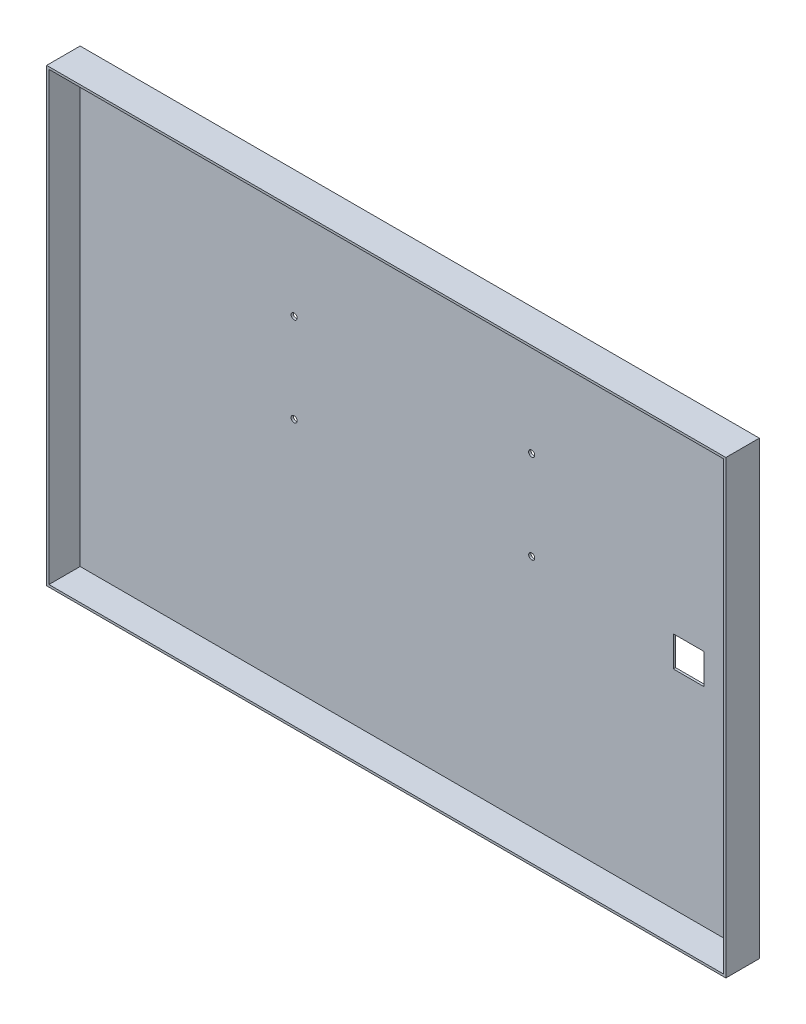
ISO-10303-21;
HEADER;
FILE_DESCRIPTION(('STEP AP214'),'2;1');
FILE_NAME('part.step','',(''),(''),'','','');
FILE_SCHEMA(('AUTOMOTIVE_DESIGN { 1 0 10303 214 1 1 1 1 }'));
ENDSEC;
DATA;
#1=APPLICATION_CONTEXT('core data for automotive mechanical design processes');
#2=APPLICATION_PROTOCOL_DEFINITION('international standard','automotive_design',2000,#1);
#3=PRODUCT_CONTEXT('',#1,'mechanical');
#4=PRODUCT('Part','Part','',(#3));
#5=PRODUCT_RELATED_PRODUCT_CATEGORY('part','',(#4));
#6=PRODUCT_DEFINITION_FORMATION('','',#4);
#7=PRODUCT_DEFINITION_CONTEXT('part definition',#1,'design');
#8=PRODUCT_DEFINITION('design','',#6,#7);
#9=PRODUCT_DEFINITION_SHAPE('','',#8);
#10=(LENGTH_UNIT() NAMED_UNIT(*) SI_UNIT(.MILLI.,.METRE.));
#11=(NAMED_UNIT(*) PLANE_ANGLE_UNIT() SI_UNIT($,.RADIAN.));
#12=(NAMED_UNIT(*) SI_UNIT($,.STERADIAN.) SOLID_ANGLE_UNIT());
#13=UNCERTAINTY_MEASURE_WITH_UNIT(LENGTH_MEASURE(1.E-05),#10,'distance_accuracy_value','');
#14=(GEOMETRIC_REPRESENTATION_CONTEXT(3) GLOBAL_UNCERTAINTY_ASSIGNED_CONTEXT((#13)) GLOBAL_UNIT_ASSIGNED_CONTEXT((#10,
#11,#12)) REPRESENTATION_CONTEXT('',''));
#15=CARTESIAN_POINT('',(0.,0.,0.));
#16=DIRECTION('',(0.,0.,1.));
#17=DIRECTION('',(1.,0.,0.));
#18=AXIS2_PLACEMENT_3D('',#15,#16,#17);
#19=CARTESIAN_POINT('',(-221.5,146.5,1.49999999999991));
#20=DIRECTION('',(-1.,0.,0.));
#21=DIRECTION('',(0.,-1.,0.));
#22=AXIS2_PLACEMENT_3D('',#19,#20,#21);
#23=PLANE('',#22);
#24=DIRECTION('',(0.,0.,-1.));
#25=VECTOR('',#24,1.);
#26=CARTESIAN_POINT('',(-221.5,-146.5,1.50000000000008));
#27=LINE('',#26,#25);
#28=CARTESIAN_POINT('',(-221.5,-146.5,22.0000000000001));
#29=VERTEX_POINT('',#28);
#30=CARTESIAN_POINT('',(-221.5,-146.5,1.5));
#31=VERTEX_POINT('',#30);
#32=EDGE_CURVE('E123',#29,#31,#27,.T.);
#33=ORIENTED_EDGE('',*,*,#32,.T.);
#34=DIRECTION('',(0.,-1.,0.));
#35=VECTOR('',#34,1.);
#36=CARTESIAN_POINT('',(-221.5,-146.5,1.50000000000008));
#37=LINE('',#36,#35);
#38=CARTESIAN_POINT('',(-221.5,146.5,1.49999999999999));
#39=VERTEX_POINT('',#38);
#40=EDGE_CURVE('E110',#39,#31,#37,.T.);
#41=ORIENTED_EDGE('',*,*,#40,.F.);
#42=DIRECTION('',(0.,0.,1.));
#43=VECTOR('',#42,1.);
#44=CARTESIAN_POINT('',(-221.5,146.5,1.49999999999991));
#45=LINE('',#44,#43);
#46=CARTESIAN_POINT('',(-221.5,146.5,22.0000000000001));
#47=VERTEX_POINT('',#46);
#48=EDGE_CURVE('E104',#39,#47,#45,.T.);
#49=ORIENTED_EDGE('',*,*,#48,.T.);
#50=DIRECTION('',(0.,-1.,0.));
#51=VECTOR('',#50,1.);
#52=CARTESIAN_POINT('',(-221.5,-148.,22.0000000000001));
#53=LINE('',#52,#51);
#54=EDGE_CURVE('E124',#29,#47,#53,.F.);
#55=ORIENTED_EDGE('',*,*,#54,.F.);
#56=EDGE_LOOP('',(#33,#41,#49,#55));
#57=FACE_BOUND('',#56,.T.);
#58=ADVANCED_FACE('F17',(#57),#23,.F.);
#59=CARTESIAN_POINT('',(-221.5,146.5,1.49999999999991));
#60=DIRECTION('',(0.,1.,0.));
#61=DIRECTION('',(0.,0.,1.));
#62=AXIS2_PLACEMENT_3D('',#59,#60,#61);
#63=PLANE('',#62);
#64=ORIENTED_EDGE('',*,*,#48,.F.);
#65=DIRECTION('',(1.,0.,0.));
#66=VECTOR('',#65,1.);
#67=CARTESIAN_POINT('',(-221.5,146.5,1.50000000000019));
#68=LINE('',#67,#66);
#69=CARTESIAN_POINT('',(221.5,146.5,1.50000000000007));
#70=VERTEX_POINT('',#69);
#71=EDGE_CURVE('E118',#70,#39,#68,.F.);
#72=ORIENTED_EDGE('',*,*,#71,.F.);
#73=DIRECTION('',(0.,0.,1.));
#74=VECTOR('',#73,1.);
#75=CARTESIAN_POINT('',(221.5,146.5,1.49999999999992));
#76=LINE('',#75,#74);
#77=CARTESIAN_POINT('',(221.5,146.5,22.));
#78=VERTEX_POINT('',#77);
#79=EDGE_CURVE('E128',#70,#78,#76,.T.);
#80=ORIENTED_EDGE('',*,*,#79,.T.);
#81=DIRECTION('',(1.,0.,0.));
#82=VECTOR('',#81,1.);
#83=CARTESIAN_POINT('',(-223.,146.5,22.0000000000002));
#84=LINE('',#83,#82);
#85=EDGE_CURVE('E198',#47,#78,#84,.T.);
#86=ORIENTED_EDGE('',*,*,#85,.F.);
#87=EDGE_LOOP('',(#64,#72,#80,#86));
#88=FACE_BOUND('',#87,.T.);
#89=ADVANCED_FACE('F202',(#88),#63,.F.);
#90=CARTESIAN_POINT('',(221.5,146.5,1.49999999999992));
#91=DIRECTION('',(1.,0.,0.));
#92=DIRECTION('',(0.,1.,0.));
#93=AXIS2_PLACEMENT_3D('',#90,#91,#92);
#94=PLANE('',#93);
#95=ORIENTED_EDGE('',*,*,#79,.F.);
#96=DIRECTION('',(0.,-1.,0.));
#97=VECTOR('',#96,1.);
#98=CARTESIAN_POINT('',(221.5,-146.5,1.50000000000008));
#99=LINE('',#98,#97);
#100=CARTESIAN_POINT('',(221.5,-146.5,1.50000000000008));
#101=VERTEX_POINT('',#100);
#102=EDGE_CURVE('E132',#101,#70,#99,.F.);
#103=ORIENTED_EDGE('',*,*,#102,.F.);
#104=DIRECTION('',(0.,0.,-1.));
#105=VECTOR('',#104,1.);
#106=CARTESIAN_POINT('',(221.5,-146.5,1.50000000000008));
#107=LINE('',#106,#105);
#108=CARTESIAN_POINT('',(221.5,-146.5,22.));
#109=VERTEX_POINT('',#108);
#110=EDGE_CURVE('E120',#101,#109,#107,.F.);
#111=ORIENTED_EDGE('',*,*,#110,.T.);
#112=DIRECTION('',(0.,-1.,0.));
#113=VECTOR('',#112,1.);
#114=CARTESIAN_POINT('',(221.5,-148.,22.0000000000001));
#115=LINE('',#114,#113);
#116=EDGE_CURVE('E196',#78,#109,#115,.T.);
#117=ORIENTED_EDGE('',*,*,#116,.F.);
#118=EDGE_LOOP('',(#95,#103,#111,#117));
#119=FACE_BOUND('',#118,.T.);
#120=ADVANCED_FACE('F205',(#119),#94,.F.);
#121=CARTESIAN_POINT('',(-221.5,-146.5,1.50000000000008));
#122=DIRECTION('',(0.,-1.,0.));
#123=DIRECTION('',(0.,0.,-1.));
#124=AXIS2_PLACEMENT_3D('',#121,#122,#123);
#125=PLANE('',#124);
#126=ORIENTED_EDGE('',*,*,#110,.F.);
#127=DIRECTION('',(1.,0.,0.));
#128=VECTOR('',#127,1.);
#129=CARTESIAN_POINT('',(-221.5,-146.5,1.50000000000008));
#130=LINE('',#129,#128);
#131=EDGE_CURVE('E116',#31,#101,#130,.T.);
#132=ORIENTED_EDGE('',*,*,#131,.F.);
#133=ORIENTED_EDGE('',*,*,#32,.F.);
#134=DIRECTION('',(1.,0.,0.));
#135=VECTOR('',#134,1.);
#136=CARTESIAN_POINT('',(-223.,-146.5,22.0000000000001));
#137=LINE('',#136,#135);
#138=EDGE_CURVE('E194',#109,#29,#137,.F.);
#139=ORIENTED_EDGE('',*,*,#138,.F.);
#140=EDGE_LOOP('',(#126,#132,#133,#139));
#141=FACE_BOUND('',#140,.T.);
#142=ADVANCED_FACE('F130',(#141),#125,.F.);
#143=CARTESIAN_POINT('',(-221.5,-146.5,1.50000000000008));
#144=DIRECTION('',(0.,0.,1.));
#145=DIRECTION('',(0.,-1.,0.));
#146=AXIS2_PLACEMENT_3D('',#143,#144,#145);
#147=PLANE('',#146);
#148=ORIENTED_EDGE('',*,*,#102,.T.);
#149=ORIENTED_EDGE('',*,*,#71,.T.);
#150=ORIENTED_EDGE('',*,*,#40,.T.);
#151=ORIENTED_EDGE('',*,*,#131,.T.);
#152=EDGE_LOOP('',(#148,#149,#150,#151));
#153=FACE_BOUND('',#152,.T.);
#154=CARTESIAN_POINT('',(-81.,66.,1.49999999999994));
#155=DIRECTION('',(0.,0.,-1.));
#156=DIRECTION('',(0.,1.,0.));
#157=AXIS2_PLACEMENT_3D('',#154,#155,#156);
#158=CIRCLE('',#157,2.);
#159=CARTESIAN_POINT('',(-81.,68.,1.49999999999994));
#160=VERTEX_POINT('',#159);
#161=EDGE_CURVE('E155',#160,#160,#158,.T.);
#162=ORIENTED_EDGE('',*,*,#161,.T.);
#163=EDGE_LOOP('',(#162));
#164=FACE_BOUND('',#163,.T.);
#165=CARTESIAN_POINT('',(-81.,7.49999999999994,1.5));
#166=DIRECTION('',(0.,0.,-1.));
#167=DIRECTION('',(0.,1.,0.));
#168=AXIS2_PLACEMENT_3D('',#165,#166,#167);
#169=CIRCLE('',#168,2.);
#170=CARTESIAN_POINT('',(-81.,9.49999999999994,1.5));
#171=VERTEX_POINT('',#170);
#172=EDGE_CURVE('E159',#171,#171,#169,.T.);
#173=ORIENTED_EDGE('',*,*,#172,.T.);
#174=EDGE_LOOP('',(#173));
#175=FACE_BOUND('',#174,.T.);
#176=CARTESIAN_POINT('',(74.9999999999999,7.49999999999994,1.5));
#177=DIRECTION('',(0.,0.,-1.));
#178=DIRECTION('',(0.,1.,0.));
#179=AXIS2_PLACEMENT_3D('',#176,#177,#178);
#180=CIRCLE('',#179,2.);
#181=CARTESIAN_POINT('',(74.9999999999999,9.49999999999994,1.5));
#182=VERTEX_POINT('',#181);
#183=EDGE_CURVE('E161',#182,#182,#180,.T.);
#184=ORIENTED_EDGE('',*,*,#183,.T.);
#185=EDGE_LOOP('',(#184));
#186=FACE_BOUND('',#185,.T.);
#187=CARTESIAN_POINT('',(74.9999999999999,66.,1.49999999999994));
#188=DIRECTION('',(0.,0.,-1.));
#189=DIRECTION('',(0.,1.,0.));
#190=AXIS2_PLACEMENT_3D('',#187,#188,#189);
#191=CIRCLE('',#190,2.);
#192=CARTESIAN_POINT('',(74.9999999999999,68.,1.49999999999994));
#193=VERTEX_POINT('',#192);
#194=EDGE_CURVE('E20',#193,#193,#191,.T.);
#195=ORIENTED_EDGE('',*,*,#194,.T.);
#196=EDGE_LOOP('',(#195));
#197=FACE_BOUND('',#196,.T.);
#198=DIRECTION('',(0.,-1.,0.));
#199=VECTOR('',#198,1.);
#200=CARTESIAN_POINT('',(168.,9.99999999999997,1.50000000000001));
#201=LINE('',#200,#199);
#202=CARTESIAN_POINT('',(168.,-10.,1.50000000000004));
#203=VERTEX_POINT('',#202);
#204=CARTESIAN_POINT('',(168.,9.99999999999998,1.50000000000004));
#205=VERTEX_POINT('',#204);
#206=EDGE_CURVE('E192',#203,#205,#201,.F.);
#207=ORIENTED_EDGE('',*,*,#206,.T.);
#208=DIRECTION('',(1.,0.,0.));
#209=VECTOR('',#208,1.);
#210=CARTESIAN_POINT('',(188.,9.99999999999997,1.5));
#211=LINE('',#210,#209);
#212=CARTESIAN_POINT('',(188.,9.99999999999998,1.50000000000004));
#213=VERTEX_POINT('',#212);
#214=EDGE_CURVE('E187',#205,#213,#211,.T.);
#215=ORIENTED_EDGE('',*,*,#214,.T.);
#216=DIRECTION('',(0.,1.,0.));
#217=VECTOR('',#216,1.);
#218=CARTESIAN_POINT('',(188.,9.99999999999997,1.5));
#219=LINE('',#218,#217);
#220=CARTESIAN_POINT('',(188.,-10.,1.50000000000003));
#221=VERTEX_POINT('',#220);
#222=EDGE_CURVE('E182',#213,#221,#219,.F.);
#223=ORIENTED_EDGE('',*,*,#222,.T.);
#224=DIRECTION('',(1.,0.,0.));
#225=VECTOR('',#224,1.);
#226=CARTESIAN_POINT('',(188.,-10.0000000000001,1.5));
#227=LINE('',#226,#225);
#228=EDGE_CURVE('E166',#221,#203,#227,.F.);
#229=ORIENTED_EDGE('',*,*,#228,.T.);
#230=EDGE_LOOP('',(#207,#215,#223,#229));
#231=FACE_BOUND('',#230,.T.);
#232=ADVANCED_FACE('F113',(#153,#164,#175,#186,#197,#231),#147,.T.);
#233=CARTESIAN_POINT('',(-223.,-148.,22.0000000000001));
#234=DIRECTION('',(0.,0.,1.));
#235=DIRECTION('',(0.,-1.,0.));
#236=AXIS2_PLACEMENT_3D('',#233,#234,#235);
#237=PLANE('',#236);
#238=DIRECTION('',(0.,-1.,0.));
#239=VECTOR('',#238,1.);
#240=CARTESIAN_POINT('',(223.,148.,22.0000000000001));
#241=LINE('',#240,#239);
#242=CARTESIAN_POINT('',(223.,-148.,22.0000000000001));
#243=VERTEX_POINT('',#242);
#244=CARTESIAN_POINT('',(223.,148.,22.0000000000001));
#245=VERTEX_POINT('',#244);
#246=EDGE_CURVE('E393',#243,#245,#241,.F.);
#247=ORIENTED_EDGE('',*,*,#246,.T.);
#248=DIRECTION('',(1.,0.,0.));
#249=VECTOR('',#248,1.);
#250=CARTESIAN_POINT('',(-223.,148.,21.9999999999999));
#251=LINE('',#250,#249);
#252=CARTESIAN_POINT('',(-223.,148.,22.));
#253=VERTEX_POINT('',#252);
#254=EDGE_CURVE('E396',#245,#253,#251,.F.);
#255=ORIENTED_EDGE('',*,*,#254,.T.);
#256=DIRECTION('',(0.,1.,0.));
#257=VECTOR('',#256,1.);
#258=CARTESIAN_POINT('',(-223.,148.,21.9999999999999));
#259=LINE('',#258,#257);
#260=CARTESIAN_POINT('',(-223.,-148.,22.0000000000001));
#261=VERTEX_POINT('',#260);
#262=EDGE_CURVE('E429',#253,#261,#259,.F.);
#263=ORIENTED_EDGE('',*,*,#262,.T.);
#264=DIRECTION('',(1.,0.,0.));
#265=VECTOR('',#264,1.);
#266=CARTESIAN_POINT('',(-223.,-148.,22.0000000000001));
#267=LINE('',#266,#265);
#268=EDGE_CURVE('E158',#261,#243,#267,.T.);
#269=ORIENTED_EDGE('',*,*,#268,.T.);
#270=EDGE_LOOP('',(#247,#255,#263,#269));
#271=FACE_BOUND('',#270,.T.);
#272=ORIENTED_EDGE('',*,*,#116,.T.);
#273=ORIENTED_EDGE('',*,*,#138,.T.);
#274=ORIENTED_EDGE('',*,*,#54,.T.);
#275=ORIENTED_EDGE('',*,*,#85,.T.);
#276=EDGE_LOOP('',(#272,#273,#274,#275));
#277=FACE_BOUND('',#276,.T.);
#278=ADVANCED_FACE('F201',(#271,#277),#237,.T.);
#279=CARTESIAN_POINT('',(168.,9.99999999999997,5.));
#280=DIRECTION('',(-1.,0.,0.));
#281=DIRECTION('',(0.,-1.,0.));
#282=AXIS2_PLACEMENT_3D('',#279,#280,#281);
#283=PLANE('',#282);
#284=DIRECTION('',(0.,0.,-1.));
#285=VECTOR('',#284,1.);
#286=CARTESIAN_POINT('',(168.,-10.0000000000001,4.99999999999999));
#287=LINE('',#286,#285);
#288=CARTESIAN_POINT('',(168.,-10.,0.));
#289=VERTEX_POINT('',#288);
#290=EDGE_CURVE('E175',#203,#289,#287,.T.);
#291=ORIENTED_EDGE('',*,*,#290,.T.);
#292=DIRECTION('',(0.,-1.,0.));
#293=VECTOR('',#292,1.);
#294=CARTESIAN_POINT('',(168.,-148.,0.));
#295=LINE('',#294,#293);
#296=CARTESIAN_POINT('',(168.,9.99999999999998,0.));
#297=VERTEX_POINT('',#296);
#298=EDGE_CURVE('E424',#289,#297,#295,.F.);
#299=ORIENTED_EDGE('',*,*,#298,.T.);
#300=DIRECTION('',(0.,0.,1.));
#301=VECTOR('',#300,1.);
#302=CARTESIAN_POINT('',(168.,9.99999999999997,5.));
#303=LINE('',#302,#301);
#304=EDGE_CURVE('E189',#297,#205,#303,.T.);
#305=ORIENTED_EDGE('',*,*,#304,.T.);
#306=ORIENTED_EDGE('',*,*,#206,.F.);
#307=EDGE_LOOP('',(#291,#299,#305,#306));
#308=FACE_BOUND('',#307,.T.);
#309=ADVANCED_FACE('F265',(#308),#283,.F.);
#310=CARTESIAN_POINT('',(188.,9.99999999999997,5.));
#311=DIRECTION('',(0.,1.,0.));
#312=DIRECTION('',(0.,0.,1.));
#313=AXIS2_PLACEMENT_3D('',#310,#311,#312);
#314=PLANE('',#313);
#315=ORIENTED_EDGE('',*,*,#304,.F.);
#316=DIRECTION('',(1.,0.,0.));
#317=VECTOR('',#316,1.);
#318=CARTESIAN_POINT('',(-223.,9.99999999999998,1.37723118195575E-13));
#319=LINE('',#318,#317);
#320=CARTESIAN_POINT('',(188.,9.99999999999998,0.));
#321=VERTEX_POINT('',#320);
#322=EDGE_CURVE('E421',#297,#321,#319,.T.);
#323=ORIENTED_EDGE('',*,*,#322,.T.);
#324=DIRECTION('',(0.,0.,1.));
#325=VECTOR('',#324,1.);
#326=CARTESIAN_POINT('',(188.,9.99999999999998,5.));
#327=LINE('',#326,#325);
#328=EDGE_CURVE('E184',#321,#213,#327,.T.);
#329=ORIENTED_EDGE('',*,*,#328,.T.);
#330=ORIENTED_EDGE('',*,*,#214,.F.);
#331=EDGE_LOOP('',(#315,#323,#329,#330));
#332=FACE_BOUND('',#331,.T.);
#333=ADVANCED_FACE('F261',(#332),#314,.F.);
#334=CARTESIAN_POINT('',(188.,9.99999999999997,5.));
#335=DIRECTION('',(1.,0.,0.));
#336=DIRECTION('',(0.,1.,0.));
#337=AXIS2_PLACEMENT_3D('',#334,#335,#336);
#338=PLANE('',#337);
#339=ORIENTED_EDGE('',*,*,#328,.F.);
#340=DIRECTION('',(0.,-1.,0.));
#341=VECTOR('',#340,1.);
#342=CARTESIAN_POINT('',(188.,-148.,0.));
#343=LINE('',#342,#341);
#344=CARTESIAN_POINT('',(188.,-10.,0.));
#345=VERTEX_POINT('',#344);
#346=EDGE_CURVE('E418',#321,#345,#343,.T.);
#347=ORIENTED_EDGE('',*,*,#346,.T.);
#348=DIRECTION('',(0.,0.,-1.));
#349=VECTOR('',#348,1.);
#350=CARTESIAN_POINT('',(188.,-10.0000000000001,4.99999999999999));
#351=LINE('',#350,#349);
#352=EDGE_CURVE('E170',#345,#221,#351,.F.);
#353=ORIENTED_EDGE('',*,*,#352,.T.);
#354=ORIENTED_EDGE('',*,*,#222,.F.);
#355=EDGE_LOOP('',(#339,#347,#353,#354));
#356=FACE_BOUND('',#355,.T.);
#357=ADVANCED_FACE('F257',(#356),#338,.F.);
#358=CARTESIAN_POINT('',(188.,-10.0000000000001,4.99999999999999));
#359=DIRECTION('',(0.,-1.,0.));
#360=DIRECTION('',(0.,0.,-1.));
#361=AXIS2_PLACEMENT_3D('',#358,#359,#360);
#362=PLANE('',#361);
#363=ORIENTED_EDGE('',*,*,#352,.F.);
#364=DIRECTION('',(1.,0.,0.));
#365=VECTOR('',#364,1.);
#366=CARTESIAN_POINT('',(-223.,-10.,1.2995156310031E-13));
#367=LINE('',#366,#365);
#368=EDGE_CURVE('E154',#345,#289,#367,.F.);
#369=ORIENTED_EDGE('',*,*,#368,.T.);
#370=ORIENTED_EDGE('',*,*,#290,.F.);
#371=ORIENTED_EDGE('',*,*,#228,.F.);
#372=EDGE_LOOP('',(#363,#369,#370,#371));
#373=FACE_BOUND('',#372,.T.);
#374=ADVANCED_FACE('F253',(#373),#362,.F.);
#375=CARTESIAN_POINT('',(74.9999999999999,66.,9.99999999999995));
#376=DIRECTION('',(0.,0.,-1.));
#377=DIRECTION('',(0.,1.,0.));
#378=AXIS2_PLACEMENT_3D('',#375,#376,#377);
#379=CYLINDRICAL_SURFACE('',#378,2.);
#380=ORIENTED_EDGE('',*,*,#194,.F.);
#381=EDGE_LOOP('',(#380));
#382=FACE_BOUND('',#381,.T.);
#383=CARTESIAN_POINT('',(74.9999999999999,66.,0.));
#384=DIRECTION('',(0.,0.,-1.));
#385=DIRECTION('',(0.,1.,0.));
#386=AXIS2_PLACEMENT_3D('',#383,#384,#385);
#387=CIRCLE('',#386,2.);
#388=CARTESIAN_POINT('',(74.9999999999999,68.,0.));
#389=VERTEX_POINT('',#388);
#390=EDGE_CURVE('E151',#389,#389,#387,.T.);
#391=ORIENTED_EDGE('',*,*,#390,.T.);
#392=EDGE_LOOP('',(#391));
#393=FACE_BOUND('',#392,.T.);
#394=ADVANCED_FACE('F249',(#382,#393),#379,.F.);
#395=CARTESIAN_POINT('',(74.9999999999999,7.49999999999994,10.));
#396=DIRECTION('',(0.,0.,-1.));
#397=DIRECTION('',(0.,1.,0.));
#398=AXIS2_PLACEMENT_3D('',#395,#396,#397);
#399=CYLINDRICAL_SURFACE('',#398,2.);
#400=ORIENTED_EDGE('',*,*,#183,.F.);
#401=EDGE_LOOP('',(#400));
#402=FACE_BOUND('',#401,.T.);
#403=CARTESIAN_POINT('',(74.9999999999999,7.49999999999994,0.));
#404=DIRECTION('',(0.,0.,-1.));
#405=DIRECTION('',(0.,1.,0.));
#406=AXIS2_PLACEMENT_3D('',#403,#404,#405);
#407=CIRCLE('',#406,2.);
#408=CARTESIAN_POINT('',(74.9999999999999,9.49999999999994,0.));
#409=VERTEX_POINT('',#408);
#410=EDGE_CURVE('E148',#409,#409,#407,.T.);
#411=ORIENTED_EDGE('',*,*,#410,.T.);
#412=EDGE_LOOP('',(#411));
#413=FACE_BOUND('',#412,.T.);
#414=ADVANCED_FACE('F245',(#402,#413),#399,.F.);
#415=CARTESIAN_POINT('',(-81.,7.49999999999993,10.));
#416=DIRECTION('',(0.,0.,-1.));
#417=DIRECTION('',(0.,1.,0.));
#418=AXIS2_PLACEMENT_3D('',#415,#416,#417);
#419=CYLINDRICAL_SURFACE('',#418,2.);
#420=ORIENTED_EDGE('',*,*,#172,.F.);
#421=EDGE_LOOP('',(#420));
#422=FACE_BOUND('',#421,.T.);
#423=CARTESIAN_POINT('',(-81.,7.49999999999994,0.));
#424=DIRECTION('',(0.,0.,-1.));
#425=DIRECTION('',(0.,1.,0.));
#426=AXIS2_PLACEMENT_3D('',#423,#424,#425);
#427=CIRCLE('',#426,2.);
#428=CARTESIAN_POINT('',(-81.,9.49999999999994,0.));
#429=VERTEX_POINT('',#428);
#430=EDGE_CURVE('E145',#429,#429,#427,.T.);
#431=ORIENTED_EDGE('',*,*,#430,.T.);
#432=EDGE_LOOP('',(#431));
#433=FACE_BOUND('',#432,.T.);
#434=ADVANCED_FACE('F241',(#422,#433),#419,.F.);
#435=CARTESIAN_POINT('',(-81.,66.,9.99999999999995));
#436=DIRECTION('',(0.,0.,-1.));
#437=DIRECTION('',(0.,1.,0.));
#438=AXIS2_PLACEMENT_3D('',#435,#436,#437);
#439=CYLINDRICAL_SURFACE('',#438,2.);
#440=ORIENTED_EDGE('',*,*,#161,.F.);
#441=EDGE_LOOP('',(#440));
#442=FACE_BOUND('',#441,.T.);
#443=CARTESIAN_POINT('',(-81.,66.,0.));
#444=DIRECTION('',(0.,0.,-1.));
#445=DIRECTION('',(0.,1.,0.));
#446=AXIS2_PLACEMENT_3D('',#443,#444,#445);
#447=CIRCLE('',#446,2.);
#448=CARTESIAN_POINT('',(-81.,68.,0.));
#449=VERTEX_POINT('',#448);
#450=EDGE_CURVE('E141',#449,#449,#447,.T.);
#451=ORIENTED_EDGE('',*,*,#450,.T.);
#452=EDGE_LOOP('',(#451));
#453=FACE_BOUND('',#452,.T.);
#454=ADVANCED_FACE('F237',(#442,#453),#439,.F.);
#455=CARTESIAN_POINT('',(-223.,-148.,22.0000000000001));
#456=DIRECTION('',(0.,1.,0.));
#457=DIRECTION('',(0.,0.,1.));
#458=AXIS2_PLACEMENT_3D('',#455,#456,#457);
#459=PLANE('',#458);
#460=DIRECTION('',(0.,0.,1.));
#461=VECTOR('',#460,1.);
#462=CARTESIAN_POINT('',(223.,-148.,21.9999999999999));
#463=LINE('',#462,#461);
#464=CARTESIAN_POINT('',(223.,-148.,0.));
#465=VERTEX_POINT('',#464);
#466=EDGE_CURVE('E400',#465,#243,#463,.T.);
#467=ORIENTED_EDGE('',*,*,#466,.T.);
#468=ORIENTED_EDGE('',*,*,#268,.F.);
#469=DIRECTION('',(0.,0.,1.));
#470=VECTOR('',#469,1.);
#471=CARTESIAN_POINT('',(-223.,-148.,21.9999999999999));
#472=LINE('',#471,#470);
#473=CARTESIAN_POINT('',(-223.,-148.,0.));
#474=VERTEX_POINT('',#473);
#475=EDGE_CURVE('E427',#261,#474,#472,.F.);
#476=ORIENTED_EDGE('',*,*,#475,.T.);
#477=DIRECTION('',(1.,0.,0.));
#478=VECTOR('',#477,1.);
#479=CARTESIAN_POINT('',(-223.,-148.,0.));
#480=LINE('',#479,#478);
#481=EDGE_CURVE('E144',#474,#465,#480,.T.);
#482=ORIENTED_EDGE('',*,*,#481,.T.);
#483=EDGE_LOOP('',(#467,#468,#476,#482));
#484=FACE_BOUND('',#483,.T.);
#485=ADVANCED_FACE('F233',(#484),#459,.F.);
#486=CARTESIAN_POINT('',(223.,148.,21.9999999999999));
#487=DIRECTION('',(-1.,0.,0.));
#488=DIRECTION('',(0.,-1.,0.));
#489=AXIS2_PLACEMENT_3D('',#486,#487,#488);
#490=PLANE('',#489);
#491=DIRECTION('',(0.,0.,-1.));
#492=VECTOR('',#491,1.);
#493=CARTESIAN_POINT('',(223.,148.,21.9999999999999));
#494=LINE('',#493,#492);
#495=CARTESIAN_POINT('',(223.,148.,0.));
#496=VERTEX_POINT('',#495);
#497=EDGE_CURVE('E399',#496,#245,#494,.F.);
#498=ORIENTED_EDGE('',*,*,#497,.T.);
#499=ORIENTED_EDGE('',*,*,#246,.F.);
#500=ORIENTED_EDGE('',*,*,#466,.F.);
#501=DIRECTION('',(0.,-1.,0.));
#502=VECTOR('',#501,1.);
#503=CARTESIAN_POINT('',(223.,-148.,0.));
#504=LINE('',#503,#502);
#505=EDGE_CURVE('E406',#465,#496,#504,.F.);
#506=ORIENTED_EDGE('',*,*,#505,.T.);
#507=EDGE_LOOP('',(#498,#499,#500,#506));
#508=FACE_BOUND('',#507,.T.);
#509=ADVANCED_FACE('F229',(#508),#490,.F.);
#510=CARTESIAN_POINT('',(-223.,148.,21.9999999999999));
#511=DIRECTION('',(0.,-1.,0.));
#512=DIRECTION('',(0.,0.,-1.));
#513=AXIS2_PLACEMENT_3D('',#510,#511,#512);
#514=PLANE('',#513);
#515=DIRECTION('',(0.,0.,1.));
#516=VECTOR('',#515,1.);
#517=CARTESIAN_POINT('',(-223.,148.,21.9999999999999));
#518=LINE('',#517,#516);
#519=CARTESIAN_POINT('',(-223.,148.,0.));
#520=VERTEX_POINT('',#519);
#521=EDGE_CURVE('E34',#520,#253,#518,.T.);
#522=ORIENTED_EDGE('',*,*,#521,.T.);
#523=ORIENTED_EDGE('',*,*,#254,.F.);
#524=ORIENTED_EDGE('',*,*,#497,.F.);
#525=DIRECTION('',(1.,0.,0.));
#526=VECTOR('',#525,1.);
#527=CARTESIAN_POINT('',(-223.,148.,1.91346848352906E-13));
#528=LINE('',#527,#526);
#529=EDGE_CURVE('E26',#496,#520,#528,.F.);
#530=ORIENTED_EDGE('',*,*,#529,.T.);
#531=EDGE_LOOP('',(#522,#523,#524,#530));
#532=FACE_BOUND('',#531,.T.);
#533=ADVANCED_FACE('F222',(#532),#514,.F.);
#534=CARTESIAN_POINT('',(-223.,148.,21.9999999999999));
#535=DIRECTION('',(1.,0.,0.));
#536=DIRECTION('',(0.,1.,0.));
#537=AXIS2_PLACEMENT_3D('',#534,#535,#536);
#538=PLANE('',#537);
#539=ORIENTED_EDGE('',*,*,#475,.F.);
#540=ORIENTED_EDGE('',*,*,#262,.F.);
#541=ORIENTED_EDGE('',*,*,#521,.F.);
#542=DIRECTION('',(0.,-1.,0.));
#543=VECTOR('',#542,1.);
#544=CARTESIAN_POINT('',(-223.,-148.,0.));
#545=LINE('',#544,#543);
#546=EDGE_CURVE('E11',#520,#474,#545,.T.);
#547=ORIENTED_EDGE('',*,*,#546,.T.);
#548=EDGE_LOOP('',(#539,#540,#541,#547));
#549=FACE_BOUND('',#548,.T.);
#550=ADVANCED_FACE('F216',(#549),#538,.F.);
#551=CARTESIAN_POINT('',(-223.,-148.,0.));
#552=DIRECTION('',(0.,0.,1.));
#553=DIRECTION('',(0.,-1.,0.));
#554=AXIS2_PLACEMENT_3D('',#551,#552,#553);
#555=PLANE('',#554);
#556=ORIENTED_EDGE('',*,*,#529,.F.);
#557=ORIENTED_EDGE('',*,*,#505,.F.);
#558=ORIENTED_EDGE('',*,*,#481,.F.);
#559=ORIENTED_EDGE('',*,*,#546,.F.);
#560=EDGE_LOOP('',(#556,#557,#558,#559));
#561=FACE_BOUND('',#560,.T.);
#562=ORIENTED_EDGE('',*,*,#450,.F.);
#563=EDGE_LOOP('',(#562));
#564=FACE_BOUND('',#563,.T.);
#565=ORIENTED_EDGE('',*,*,#430,.F.);
#566=EDGE_LOOP('',(#565));
#567=FACE_BOUND('',#566,.T.);
#568=ORIENTED_EDGE('',*,*,#410,.F.);
#569=EDGE_LOOP('',(#568));
#570=FACE_BOUND('',#569,.T.);
#571=ORIENTED_EDGE('',*,*,#390,.F.);
#572=EDGE_LOOP('',(#571));
#573=FACE_BOUND('',#572,.T.);
#574=ORIENTED_EDGE('',*,*,#346,.F.);
#575=ORIENTED_EDGE('',*,*,#322,.F.);
#576=ORIENTED_EDGE('',*,*,#298,.F.);
#577=ORIENTED_EDGE('',*,*,#368,.F.);
#578=EDGE_LOOP('',(#574,#575,#576,#577));
#579=FACE_BOUND('',#578,.T.);
#580=ADVANCED_FACE('F214',(#561,#564,#567,#570,#573,#579),#555,.F.);
#581=CLOSED_SHELL('',(#58,#89,#120,#142,#232,#278,#309,#333,#357,#374,#394,#414,#434,#454,#485,
#509,#533,#550,#580));
#582=MANIFOLD_SOLID_BREP('B1',#581);
#583=ADVANCED_BREP_SHAPE_REPRESENTATION('',(#18,#582),#14);
#584=SHAPE_DEFINITION_REPRESENTATION(#9,#583);
ENDSEC;
END-ISO-10303-21;
